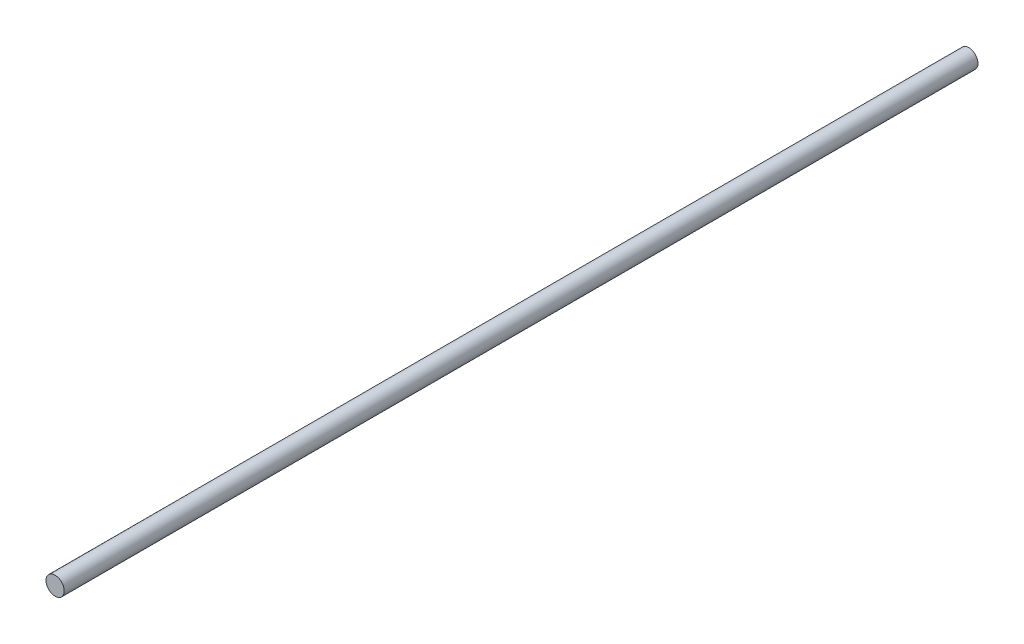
from build123d import *

# Parameters (mm, degrees)
ESQUISSE1_R        = 6
BOSS_EXTRU_1_DEPTH = 600


with BuildPart() as part:
    # Esquisse1 → Boss.-Extru.1 (new body)
    with BuildSketch(Plane.XY):
        Circle(ESQUISSE1_R)
    extrude(amount=BOSS_EXTRU_1_DEPTH)


solid = part.part
